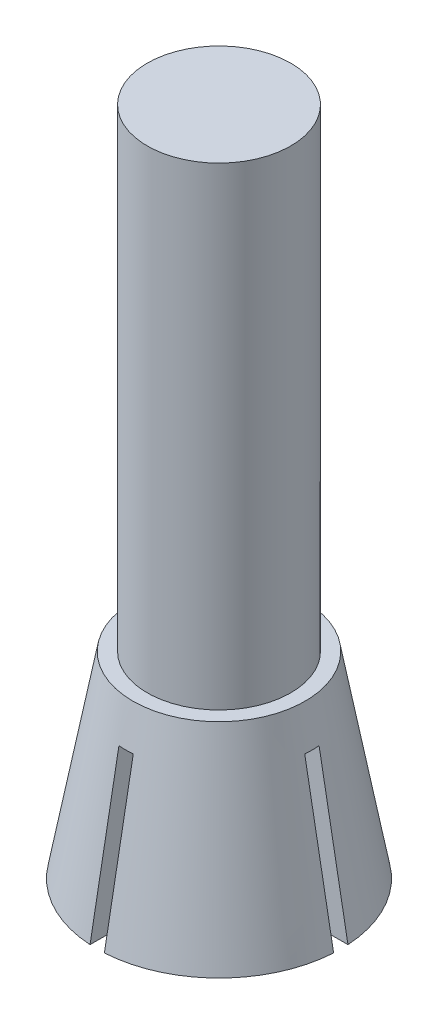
ISO-10303-21;
HEADER;
FILE_DESCRIPTION(('STEP AP214'),'2;1');
FILE_NAME('part.step','',(''),(''),'','','');
FILE_SCHEMA(('AUTOMOTIVE_DESIGN { 1 0 10303 214 1 1 1 1 }'));
ENDSEC;
DATA;
#1=APPLICATION_CONTEXT('core data for automotive mechanical design processes');
#2=APPLICATION_PROTOCOL_DEFINITION('international standard','automotive_design',2000,#1);
#3=PRODUCT_CONTEXT('',#1,'mechanical');
#4=PRODUCT('Part','Part','',(#3));
#5=PRODUCT_RELATED_PRODUCT_CATEGORY('part','',(#4));
#6=PRODUCT_DEFINITION_FORMATION('','',#4);
#7=PRODUCT_DEFINITION_CONTEXT('part definition',#1,'design');
#8=PRODUCT_DEFINITION('design','',#6,#7);
#9=PRODUCT_DEFINITION_SHAPE('','',#8);
#10=(LENGTH_UNIT() NAMED_UNIT(*) SI_UNIT(.MILLI.,.METRE.));
#11=(NAMED_UNIT(*) PLANE_ANGLE_UNIT() SI_UNIT($,.RADIAN.));
#12=(NAMED_UNIT(*) SI_UNIT($,.STERADIAN.) SOLID_ANGLE_UNIT());
#13=UNCERTAINTY_MEASURE_WITH_UNIT(LENGTH_MEASURE(1.E-05),#10,'distance_accuracy_value','');
#14=(GEOMETRIC_REPRESENTATION_CONTEXT(3) GLOBAL_UNCERTAINTY_ASSIGNED_CONTEXT((#13)) GLOBAL_UNIT_ASSIGNED_CONTEXT((#10,
#11,#12)) REPRESENTATION_CONTEXT('',''));
#15=CARTESIAN_POINT('',(0.,0.,0.));
#16=DIRECTION('',(0.,0.,1.));
#17=DIRECTION('',(1.,0.,0.));
#18=AXIS2_PLACEMENT_3D('',#15,#16,#17);
#19=CARTESIAN_POINT('',(4.25,0.,0.));
#20=DIRECTION('',(0.,-1.,0.));
#21=DIRECTION('',(0.,0.,-1.));
#22=AXIS2_PLACEMENT_3D('',#19,#20,#21);
#23=PLANE('',#22);
#24=DIRECTION('',(-1.,0.,0.));
#25=VECTOR('',#24,1.);
#26=CARTESIAN_POINT('',(-5.,0.,0.25));
#27=LINE('',#26,#25);
#28=CARTESIAN_POINT('',(-1.5499677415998,0.,0.25));
#29=VERTEX_POINT('',#28);
#30=CARTESIAN_POINT('',(-4.24264068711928,0.,0.25));
#31=VERTEX_POINT('',#30);
#32=EDGE_CURVE('E149',#29,#31,#27,.T.);
#33=ORIENTED_EDGE('',*,*,#32,.F.);
#34=CARTESIAN_POINT('',(0.,0.,0.));
#35=DIRECTION('',(0.,-1.,0.));
#36=DIRECTION('',(0.,0.,-1.));
#37=AXIS2_PLACEMENT_3D('',#34,#35,#36);
#38=CIRCLE('',#37,1.57);
#39=CARTESIAN_POINT('',(-0.25,0.,1.5499677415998));
#40=VERTEX_POINT('',#39);
#41=EDGE_CURVE('E163',#40,#29,#38,.T.);
#42=ORIENTED_EDGE('',*,*,#41,.F.);
#43=DIRECTION('',(0.,0.,-1.));
#44=VECTOR('',#43,1.);
#45=CARTESIAN_POINT('',(-0.25,0.,0.25));
#46=LINE('',#45,#44);
#47=CARTESIAN_POINT('',(-0.25,0.,4.24264068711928));
#48=VERTEX_POINT('',#47);
#49=EDGE_CURVE('E250',#48,#40,#46,.T.);
#50=ORIENTED_EDGE('',*,*,#49,.F.);
#51=CARTESIAN_POINT('',(0.,0.,0.));
#52=DIRECTION('',(0.,-1.,0.));
#53=DIRECTION('',(0.,0.,-1.));
#54=AXIS2_PLACEMENT_3D('',#51,#52,#53);
#55=CIRCLE('',#54,4.25);
#56=EDGE_CURVE('E165',#48,#31,#55,.T.);
#57=ORIENTED_EDGE('',*,*,#56,.T.);
#58=EDGE_LOOP('',(#33,#42,#50,#57));
#59=FACE_BOUND('',#58,.T.);
#60=ADVANCED_FACE('F34',(#59),#23,.T.);
#61=DIRECTION('',(0.,0.,1.));
#62=VECTOR('',#61,1.);
#63=CARTESIAN_POINT('',(0.25,0.,5.));
#64=LINE('',#63,#62);
#65=CARTESIAN_POINT('',(0.25,0.,1.5499677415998));
#66=VERTEX_POINT('',#65);
#67=CARTESIAN_POINT('',(0.25,0.,4.24264068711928));
#68=VERTEX_POINT('',#67);
#69=EDGE_CURVE('E248',#66,#68,#64,.T.);
#70=ORIENTED_EDGE('',*,*,#69,.F.);
#71=CARTESIAN_POINT('',(1.5499677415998,0.,0.25));
#72=VERTEX_POINT('',#71);
#73=EDGE_CURVE('E174',#72,#66,#38,.T.);
#74=ORIENTED_EDGE('',*,*,#73,.F.);
#75=DIRECTION('',(-1.,0.,0.));
#76=VECTOR('',#75,1.);
#77=CARTESIAN_POINT('',(0.25,0.,0.25));
#78=LINE('',#77,#76);
#79=CARTESIAN_POINT('',(4.24264068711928,0.,0.25));
#80=VERTEX_POINT('',#79);
#81=EDGE_CURVE('E246',#80,#72,#78,.T.);
#82=ORIENTED_EDGE('',*,*,#81,.F.);
#83=EDGE_CURVE('E190',#80,#68,#55,.T.);
#84=ORIENTED_EDGE('',*,*,#83,.T.);
#85=EDGE_LOOP('',(#70,#74,#82,#84));
#86=FACE_BOUND('',#85,.T.);
#87=ADVANCED_FACE('F352',(#86),#23,.T.);
#88=DIRECTION('',(1.,0.,0.));
#89=VECTOR('',#88,1.);
#90=CARTESIAN_POINT('',(5.,0.,-0.25));
#91=LINE('',#90,#89);
#92=CARTESIAN_POINT('',(1.5499677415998,0.,-0.25));
#93=VERTEX_POINT('',#92);
#94=CARTESIAN_POINT('',(4.24264068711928,0.,-0.25));
#95=VERTEX_POINT('',#94);
#96=EDGE_CURVE('E244',#93,#95,#91,.T.);
#97=ORIENTED_EDGE('',*,*,#96,.F.);
#98=CARTESIAN_POINT('',(0.25,0.,-1.5499677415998));
#99=VERTEX_POINT('',#98);
#100=EDGE_CURVE('E178',#99,#93,#38,.T.);
#101=ORIENTED_EDGE('',*,*,#100,.F.);
#102=DIRECTION('',(0.,0.,1.));
#103=VECTOR('',#102,1.);
#104=CARTESIAN_POINT('',(0.25,0.,-0.25));
#105=LINE('',#104,#103);
#106=CARTESIAN_POINT('',(0.25,0.,-4.24264068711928));
#107=VERTEX_POINT('',#106);
#108=EDGE_CURVE('E239',#107,#99,#105,.T.);
#109=ORIENTED_EDGE('',*,*,#108,.F.);
#110=EDGE_CURVE('E186',#107,#95,#55,.T.);
#111=ORIENTED_EDGE('',*,*,#110,.T.);
#112=EDGE_LOOP('',(#97,#101,#109,#111));
#113=FACE_BOUND('',#112,.T.);
#114=ADVANCED_FACE('F356',(#113),#23,.T.);
#115=CARTESIAN_POINT('',(0.,23.35,0.));
#116=DIRECTION('',(0.,1.,0.));
#117=DIRECTION('',(0.,0.,1.));
#118=AXIS2_PLACEMENT_3D('',#115,#116,#117);
#119=PLANE('',#118);
#120=CARTESIAN_POINT('',(0.,23.35,0.));
#121=DIRECTION('',(0.,-1.,0.));
#122=DIRECTION('',(0.,0.,-1.));
#123=AXIS2_PLACEMENT_3D('',#120,#121,#122);
#124=CIRCLE('',#123,2.5);
#125=CARTESIAN_POINT('',(0.,23.35,-2.5));
#126=VERTEX_POINT('',#125);
#127=EDGE_CURVE('E196',#126,#126,#124,.T.);
#128=ORIENTED_EDGE('',*,*,#127,.F.);
#129=EDGE_LOOP('',(#128));
#130=FACE_BOUND('',#129,.T.);
#131=ADVANCED_FACE('F36',(#130),#119,.T.);
#132=CARTESIAN_POINT('',(0.,0.,0.));
#133=DIRECTION('',(0.,-1.,0.));
#134=DIRECTION('',(0.,0.,-1.));
#135=AXIS2_PLACEMENT_3D('',#132,#133,#134);
#136=CYLINDRICAL_SURFACE('',#135,2.5);
#137=ORIENTED_EDGE('',*,*,#127,.T.);
#138=EDGE_LOOP('',(#137));
#139=FACE_BOUND('',#138,.T.);
#140=CARTESIAN_POINT('',(0.,6.85,0.));
#141=DIRECTION('',(0.,-1.,0.));
#142=DIRECTION('',(0.,0.,-1.));
#143=AXIS2_PLACEMENT_3D('',#140,#141,#142);
#144=CIRCLE('',#143,2.5);
#145=CARTESIAN_POINT('',(0.,6.85,-2.5));
#146=VERTEX_POINT('',#145);
#147=EDGE_CURVE('E193',#146,#146,#144,.T.);
#148=ORIENTED_EDGE('',*,*,#147,.F.);
#149=EDGE_LOOP('',(#148));
#150=FACE_BOUND('',#149,.T.);
#151=ADVANCED_FACE('F368',(#139,#150),#136,.T.);
#152=CARTESIAN_POINT('',(2.5,6.85,0.));
#153=DIRECTION('',(0.,1.,0.));
#154=DIRECTION('',(0.,0.,1.));
#155=AXIS2_PLACEMENT_3D('',#152,#153,#154);
#156=PLANE('',#155);
#157=ORIENTED_EDGE('',*,*,#147,.T.);
#158=EDGE_LOOP('',(#157));
#159=FACE_BOUND('',#158,.T.);
#160=CARTESIAN_POINT('',(0.,6.85,0.));
#161=DIRECTION('',(0.,-1.,0.));
#162=DIRECTION('',(0.,0.,-1.));
#163=AXIS2_PLACEMENT_3D('',#160,#161,#162);
#164=CIRCLE('',#163,3.);
#165=CARTESIAN_POINT('',(0.,6.85,-3.));
#166=VERTEX_POINT('',#165);
#167=EDGE_CURVE('E189',#166,#166,#164,.T.);
#168=ORIENTED_EDGE('',*,*,#167,.F.);
#169=EDGE_LOOP('',(#168));
#170=FACE_BOUND('',#169,.T.);
#171=ADVANCED_FACE('F276',(#159,#170),#156,.T.);
#172=CARTESIAN_POINT('',(0.,0.,0.));
#173=DIRECTION('',(0.,-1.,0.));
#174=DIRECTION('',(0.,0.,-1.));
#175=AXIS2_PLACEMENT_3D('',#172,#173,#174);
#176=CONICAL_SURFACE('',#175,4.25,0.180495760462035);
#177=CARTESIAN_POINT('',(-5.33756511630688,-5.99192317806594,0.25));
#178=CARTESIAN_POINT('',(-5.12951728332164,-4.85308658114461,0.25));
#179=CARTESIAN_POINT('',(-4.92144923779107,-3.71425367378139,0.25));
#180=CARTESIAN_POINT('',(-4.50523678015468,-1.43660071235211,0.25));
#181=CARTESIAN_POINT('',(-4.29709236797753,-0.297780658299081,0.25));
#182=CARTESIAN_POINT('',(-3.98479180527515,1.41043410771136,0.25));
#183=CARTESIAN_POINT('',(-3.88067762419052,1.97983649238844,0.25));
#184=CARTESIAN_POINT('',(-3.67241302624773,3.11863453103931,0.25));
#185=CARTESIAN_POINT('',(-3.56826260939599,3.68803018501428,0.25));
#186=CARTESIAN_POINT('',(-3.35991518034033,4.82681233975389,0.25));
#187=CARTESIAN_POINT('',(-3.25571816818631,5.39619884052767,0.25));
#188=CARTESIAN_POINT('',(-3.04726212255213,6.53496085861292,0.25));
#189=CARTESIAN_POINT('',(-2.94300308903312,7.10433637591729,0.25));
#190=CARTESIAN_POINT('',(-2.74122250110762,8.2058308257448,0.25));
#191=CARTESIAN_POINT('',(-2.64370630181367,8.73795073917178,0.25));
#192=CARTESIAN_POINT('',(-2.44857160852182,9.80217157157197,0.25));
#193=CARTESIAN_POINT('',(-2.35095311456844,10.3342724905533,0.25));
#194=CARTESIAN_POINT('',(-2.15556967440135,11.3984456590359,0.25));
#195=CARTESIAN_POINT('',(-2.05780472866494,11.9305179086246,0.25));
#196=CARTESIAN_POINT('',(-1.86205176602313,12.9946223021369,0.25));
#197=CARTESIAN_POINT('',(-1.76406374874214,13.5266544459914,0.25));
#198=CARTESIAN_POINT('',(-1.56773112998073,14.5906594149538,0.25));
#199=CARTESIAN_POINT('',(-1.46938652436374,15.1226322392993,0.25));
#200=CARTESIAN_POINT('',(-1.32138614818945,15.920500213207,0.25));
#201=CARTESIAN_POINT('',(-1.27197225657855,16.1864402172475,0.25));
#202=CARTESIAN_POINT('',(-1.1729137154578,16.7182777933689,0.25));
#203=CARTESIAN_POINT('',(-1.12326906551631,16.9841753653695,0.25));
#204=CARTESIAN_POINT('',(-1.02364003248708,17.5159123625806,0.25));
#205=CARTESIAN_POINT('',(-0.97365564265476,17.7817517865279,0.25));
#206=CARTESIAN_POINT('',(-0.873163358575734,18.3133305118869,0.25));
#207=CARTESIAN_POINT('',(-0.822655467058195,18.5790698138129,0.25));
#208=CARTESIAN_POINT('',(-0.74621709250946,18.9775524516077,0.25));
#209=CARTESIAN_POINT('',(-0.720624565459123,19.1103605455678,0.25));
#210=CARTESIAN_POINT('',(-0.66912430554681,19.3759151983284,0.25));
#211=CARTESIAN_POINT('',(-0.64321657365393,19.5086617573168,0.25));
#212=CARTESIAN_POINT('',(-0.590965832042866,19.7740721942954,0.25));
#213=CARTESIAN_POINT('',(-0.564622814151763,19.9067360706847,0.25));
#214=CARTESIAN_POINT('',(-0.511242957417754,20.1719254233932,0.25));
#215=CARTESIAN_POINT('',(-0.484206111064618,20.3044508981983,0.25));
#216=CARTESIAN_POINT('',(-0.456693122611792,20.4368791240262,0.25));
#217=B_SPLINE_CURVE_WITH_KNOTS('',3,(#177,#178,#179,#180,#181,#182,#183,#184,#185,#186,#187,
#188,#189,#190,#191,#192,#193,#194,#195,#196,#197,#198,#199,#200,#201,#202,#203,#204,#205,#206,
#207,#208,#209,#210,#211,#212,#213,#214,#215,#216),.UNSPECIFIED.,.F.,.F.,(4,2,2,2,2,2,2,2,2,2,2,
2,2,2,2,2,2,2,2,4),(0.,3.47305258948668,6.94610843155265,8.68263644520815,10.4191641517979,
12.1556900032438,13.8922169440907,15.5151615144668,17.1381053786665,18.7610439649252,
20.3839852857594,22.0069454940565,22.8184208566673,23.6298977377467,24.4413907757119,
25.2528795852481,25.658633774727,26.0643867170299,26.4701472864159,26.8759122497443),.UNSPECIFIED.);
#218=CARTESIAN_POINT('',(-3.23670985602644,5.5,0.25));
#219=VERTEX_POINT('',#218);
#220=EDGE_CURVE('E315',#31,#219,#217,.T.);
#221=ORIENTED_EDGE('',*,*,#220,.F.);
#222=ORIENTED_EDGE('',*,*,#56,.F.);
#223=CARTESIAN_POINT('',(-0.25,-5.99192317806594,5.33756511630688));
#224=CARTESIAN_POINT('',(-0.25,-4.85308658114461,5.12951728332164));
#225=CARTESIAN_POINT('',(-0.25,-3.71425367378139,4.92144923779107));
#226=CARTESIAN_POINT('',(-0.25,-1.43660071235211,4.50523678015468));
#227=CARTESIAN_POINT('',(-0.25,-0.297780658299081,4.29709236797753));
#228=CARTESIAN_POINT('',(-0.25,1.41043410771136,3.98479180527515));
#229=CARTESIAN_POINT('',(-0.25,1.97983649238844,3.88067762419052));
#230=CARTESIAN_POINT('',(-0.25,3.11863453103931,3.67241302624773));
#231=CARTESIAN_POINT('',(-0.25,3.68803018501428,3.56826260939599));
#232=CARTESIAN_POINT('',(-0.25,4.82681233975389,3.35991518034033));
#233=CARTESIAN_POINT('',(-0.25,5.39619884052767,3.25571816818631));
#234=CARTESIAN_POINT('',(-0.25,6.53496085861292,3.04726212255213));
#235=CARTESIAN_POINT('',(-0.25,7.10433637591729,2.94300308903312));
#236=CARTESIAN_POINT('',(-0.25,8.2058308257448,2.74122250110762));
#237=CARTESIAN_POINT('',(-0.25,8.73795073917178,2.64370630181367));
#238=CARTESIAN_POINT('',(-0.25,9.80217157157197,2.44857160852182));
#239=CARTESIAN_POINT('',(-0.25,10.3342724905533,2.35095311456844));
#240=CARTESIAN_POINT('',(-0.25,11.3984456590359,2.15556967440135));
#241=CARTESIAN_POINT('',(-0.25,11.9305179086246,2.05780472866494));
#242=CARTESIAN_POINT('',(-0.25,12.9946223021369,1.86205176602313));
#243=CARTESIAN_POINT('',(-0.25,13.5266544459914,1.76406374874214));
#244=CARTESIAN_POINT('',(-0.25,14.5906594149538,1.56773112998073));
#245=CARTESIAN_POINT('',(-0.25,15.1226322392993,1.46938652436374));
#246=CARTESIAN_POINT('',(-0.25,15.920500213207,1.32138614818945));
#247=CARTESIAN_POINT('',(-0.25,16.1864402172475,1.27197225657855));
#248=CARTESIAN_POINT('',(-0.25,16.7182777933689,1.1729137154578));
#249=CARTESIAN_POINT('',(-0.25,16.9841753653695,1.12326906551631));
#250=CARTESIAN_POINT('',(-0.25,17.5159123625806,1.02364003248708));
#251=CARTESIAN_POINT('',(-0.25,17.7817517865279,0.97365564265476));
#252=CARTESIAN_POINT('',(-0.25,18.3133305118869,0.873163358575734));
#253=CARTESIAN_POINT('',(-0.25,18.5790698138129,0.822655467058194));
#254=CARTESIAN_POINT('',(-0.25,18.9775524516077,0.74621709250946));
#255=CARTESIAN_POINT('',(-0.25,19.1103605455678,0.720624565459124));
#256=CARTESIAN_POINT('',(-0.25,19.3759151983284,0.66912430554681));
#257=CARTESIAN_POINT('',(-0.25,19.5086617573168,0.64321657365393));
#258=CARTESIAN_POINT('',(-0.25,19.7740721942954,0.590965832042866));
#259=CARTESIAN_POINT('',(-0.25,19.9067360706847,0.564622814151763));
#260=CARTESIAN_POINT('',(-0.25,20.1719254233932,0.511242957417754));
#261=CARTESIAN_POINT('',(-0.25,20.3044508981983,0.484206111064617));
#262=CARTESIAN_POINT('',(-0.25,20.4368791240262,0.456693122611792));
#263=B_SPLINE_CURVE_WITH_KNOTS('',3,(#223,#224,#225,#226,#227,#228,#229,#230,#231,#232,#233,
#234,#235,#236,#237,#238,#239,#240,#241,#242,#243,#244,#245,#246,#247,#248,#249,#250,#251,#252,
#253,#254,#255,#256,#257,#258,#259,#260,#261,#262),.UNSPECIFIED.,.F.,.F.,(4,2,2,2,2,2,2,2,2,2,2,
2,2,2,2,2,2,2,2,4),(0.,3.47305258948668,6.94610843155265,8.68263644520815,10.4191641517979,
12.1556900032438,13.8922169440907,15.5151615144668,17.1381053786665,18.7610439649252,
20.3839852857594,22.0069454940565,22.8184208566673,23.6298977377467,24.4413907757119,
25.2528795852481,25.658633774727,26.0643867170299,26.4701472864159,26.8759122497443),.UNSPECIFIED.);
#264=CARTESIAN_POINT('',(-0.25,5.5,3.23670985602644));
#265=VERTEX_POINT('',#264);
#266=EDGE_CURVE('E310',#265,#48,#263,.F.);
#267=ORIENTED_EDGE('',*,*,#266,.F.);
#268=CARTESIAN_POINT('',(0.,5.5,0.));
#269=DIRECTION('',(0.,-1.,0.));
#270=DIRECTION('',(0.,0.,-1.));
#271=AXIS2_PLACEMENT_3D('',#268,#269,#270);
#272=CIRCLE('',#271,3.2463503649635);
#273=CARTESIAN_POINT('',(0.25,5.5,3.23670985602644));
#274=VERTEX_POINT('',#273);
#275=EDGE_CURVE('E397',#265,#274,#272,.F.);
#276=ORIENTED_EDGE('',*,*,#275,.T.);
#277=CARTESIAN_POINT('',(0.25,-5.99192317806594,5.33756511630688));
#278=CARTESIAN_POINT('',(0.25,-4.85308658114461,5.12951728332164));
#279=CARTESIAN_POINT('',(0.25,-3.71425367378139,4.92144923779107));
#280=CARTESIAN_POINT('',(0.25,-1.43660071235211,4.50523678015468));
#281=CARTESIAN_POINT('',(0.25,-0.297780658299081,4.29709236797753));
#282=CARTESIAN_POINT('',(0.25,1.41043410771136,3.98479180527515));
#283=CARTESIAN_POINT('',(0.25,1.97983649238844,3.88067762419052));
#284=CARTESIAN_POINT('',(0.25,3.11863453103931,3.67241302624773));
#285=CARTESIAN_POINT('',(0.25,3.68803018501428,3.56826260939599));
#286=CARTESIAN_POINT('',(0.25,4.82681233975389,3.35991518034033));
#287=CARTESIAN_POINT('',(0.25,5.39619884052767,3.25571816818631));
#288=CARTESIAN_POINT('',(0.25,6.53496085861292,3.04726212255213));
#289=CARTESIAN_POINT('',(0.25,7.10433637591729,2.94300308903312));
#290=CARTESIAN_POINT('',(0.25,8.2058308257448,2.74122250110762));
#291=CARTESIAN_POINT('',(0.25,8.73795073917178,2.64370630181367));
#292=CARTESIAN_POINT('',(0.25,9.80217157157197,2.44857160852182));
#293=CARTESIAN_POINT('',(0.25,10.3342724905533,2.35095311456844));
#294=CARTESIAN_POINT('',(0.25,11.3984456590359,2.15556967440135));
#295=CARTESIAN_POINT('',(0.25,11.9305179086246,2.05780472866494));
#296=CARTESIAN_POINT('',(0.25,12.9946223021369,1.86205176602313));
#297=CARTESIAN_POINT('',(0.25,13.5266544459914,1.76406374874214));
#298=CARTESIAN_POINT('',(0.25,14.5906594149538,1.56773112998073));
#299=CARTESIAN_POINT('',(0.25,15.1226322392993,1.46938652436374));
#300=CARTESIAN_POINT('',(0.25,15.920500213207,1.32138614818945));
#301=CARTESIAN_POINT('',(0.25,16.1864402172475,1.27197225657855));
#302=CARTESIAN_POINT('',(0.25,16.7182777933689,1.1729137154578));
#303=CARTESIAN_POINT('',(0.25,16.9841753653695,1.12326906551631));
#304=CARTESIAN_POINT('',(0.25,17.5159123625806,1.02364003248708));
#305=CARTESIAN_POINT('',(0.25,17.7817517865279,0.97365564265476));
#306=CARTESIAN_POINT('',(0.25,18.3133305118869,0.873163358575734));
#307=CARTESIAN_POINT('',(0.25,18.5790698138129,0.822655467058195));
#308=CARTESIAN_POINT('',(0.25,18.9775524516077,0.74621709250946));
#309=CARTESIAN_POINT('',(0.25,19.1103605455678,0.720624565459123));
#310=CARTESIAN_POINT('',(0.25,19.3759151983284,0.66912430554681));
#311=CARTESIAN_POINT('',(0.25,19.5086617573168,0.64321657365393));
#312=CARTESIAN_POINT('',(0.25,19.7740721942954,0.590965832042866));
#313=CARTESIAN_POINT('',(0.25,19.9067360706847,0.564622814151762));
#314=CARTESIAN_POINT('',(0.25,20.1719254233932,0.511242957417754));
#315=CARTESIAN_POINT('',(0.25,20.3044508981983,0.484206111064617));
#316=CARTESIAN_POINT('',(0.25,20.4368791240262,0.456693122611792));
#317=B_SPLINE_CURVE_WITH_KNOTS('',3,(#277,#278,#279,#280,#281,#282,#283,#284,#285,#286,#287,
#288,#289,#290,#291,#292,#293,#294,#295,#296,#297,#298,#299,#300,#301,#302,#303,#304,#305,#306,
#307,#308,#309,#310,#311,#312,#313,#314,#315,#316),.UNSPECIFIED.,.F.,.F.,(4,2,2,2,2,2,2,2,2,2,2,
2,2,2,2,2,2,2,2,4),(0.,3.47305258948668,6.94610843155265,8.68263644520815,10.4191641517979,
12.1556900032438,13.8922169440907,15.5151615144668,17.1381053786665,18.7610439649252,
20.3839852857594,22.0069454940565,22.8184208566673,23.6298977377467,24.4413907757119,
25.2528795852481,25.658633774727,26.0643867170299,26.4701472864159,26.8759122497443),.UNSPECIFIED.);
#318=EDGE_CURVE('E304',#68,#274,#317,.T.);
#319=ORIENTED_EDGE('',*,*,#318,.F.);
#320=ORIENTED_EDGE('',*,*,#83,.F.);
#321=CARTESIAN_POINT('',(5.33756511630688,-5.99192317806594,0.25));
#322=CARTESIAN_POINT('',(5.12951728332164,-4.85308658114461,0.25));
#323=CARTESIAN_POINT('',(4.92144923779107,-3.71425367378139,0.25));
#324=CARTESIAN_POINT('',(4.50523678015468,-1.43660071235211,0.25));
#325=CARTESIAN_POINT('',(4.29709236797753,-0.297780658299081,0.25));
#326=CARTESIAN_POINT('',(3.98479180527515,1.41043410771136,0.25));
#327=CARTESIAN_POINT('',(3.88067762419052,1.97983649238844,0.25));
#328=CARTESIAN_POINT('',(3.67241302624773,3.11863453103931,0.25));
#329=CARTESIAN_POINT('',(3.56826260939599,3.68803018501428,0.25));
#330=CARTESIAN_POINT('',(3.35991518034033,4.82681233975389,0.25));
#331=CARTESIAN_POINT('',(3.25571816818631,5.39619884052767,0.25));
#332=CARTESIAN_POINT('',(3.04726212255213,6.53496085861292,0.25));
#333=CARTESIAN_POINT('',(2.94300308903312,7.10433637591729,0.25));
#334=CARTESIAN_POINT('',(2.74122250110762,8.2058308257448,0.25));
#335=CARTESIAN_POINT('',(2.64370630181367,8.73795073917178,0.25));
#336=CARTESIAN_POINT('',(2.44857160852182,9.80217157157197,0.25));
#337=CARTESIAN_POINT('',(2.35095311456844,10.3342724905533,0.25));
#338=CARTESIAN_POINT('',(2.15556967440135,11.3984456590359,0.25));
#339=CARTESIAN_POINT('',(2.05780472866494,11.9305179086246,0.25));
#340=CARTESIAN_POINT('',(1.86205176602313,12.9946223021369,0.25));
#341=CARTESIAN_POINT('',(1.76406374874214,13.5266544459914,0.25));
#342=CARTESIAN_POINT('',(1.56773112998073,14.5906594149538,0.25));
#343=CARTESIAN_POINT('',(1.46938652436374,15.1226322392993,0.25));
#344=CARTESIAN_POINT('',(1.32138614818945,15.920500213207,0.25));
#345=CARTESIAN_POINT('',(1.27197225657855,16.1864402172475,0.25));
#346=CARTESIAN_POINT('',(1.1729137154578,16.7182777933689,0.25));
#347=CARTESIAN_POINT('',(1.12326906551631,16.9841753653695,0.25));
#348=CARTESIAN_POINT('',(1.02364003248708,17.5159123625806,0.25));
#349=CARTESIAN_POINT('',(0.97365564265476,17.7817517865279,0.25));
#350=CARTESIAN_POINT('',(0.873163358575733,18.3133305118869,0.25));
#351=CARTESIAN_POINT('',(0.822655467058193,18.5790698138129,0.25));
#352=CARTESIAN_POINT('',(0.746217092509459,18.9775524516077,0.25));
#353=CARTESIAN_POINT('',(0.720624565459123,19.1103605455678,0.25));
#354=CARTESIAN_POINT('',(0.669124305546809,19.3759151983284,0.25));
#355=CARTESIAN_POINT('',(0.643216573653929,19.5086617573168,0.25));
#356=CARTESIAN_POINT('',(0.590965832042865,19.7740721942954,0.25));
#357=CARTESIAN_POINT('',(0.564622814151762,19.9067360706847,0.25));
#358=CARTESIAN_POINT('',(0.511242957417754,20.1719254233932,0.25));
#359=CARTESIAN_POINT('',(0.484206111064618,20.3044508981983,0.25));
#360=CARTESIAN_POINT('',(0.456693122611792,20.4368791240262,0.25));
#361=B_SPLINE_CURVE_WITH_KNOTS('',3,(#321,#322,#323,#324,#325,#326,#327,#328,#329,#330,#331,
#332,#333,#334,#335,#336,#337,#338,#339,#340,#341,#342,#343,#344,#345,#346,#347,#348,#349,#350,
#351,#352,#353,#354,#355,#356,#357,#358,#359,#360),.UNSPECIFIED.,.F.,.F.,(4,2,2,2,2,2,2,2,2,2,2,
2,2,2,2,2,2,2,2,4),(0.,3.47305258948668,6.94610843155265,8.68263644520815,10.4191641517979,
12.1556900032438,13.8922169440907,15.5151615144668,17.1381053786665,18.7610439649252,
20.3839852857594,22.0069454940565,22.8184208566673,23.6298977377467,24.4413907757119,
25.2528795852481,25.658633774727,26.0643867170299,26.4701472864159,26.8759122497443),.UNSPECIFIED.);
#362=CARTESIAN_POINT('',(3.23670985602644,5.5,0.25));
#363=VERTEX_POINT('',#362);
#364=EDGE_CURVE('E298',#363,#80,#361,.F.);
#365=ORIENTED_EDGE('',*,*,#364,.F.);
#366=CARTESIAN_POINT('',(3.23670985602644,5.5,-0.25));
#367=VERTEX_POINT('',#366);
#368=EDGE_CURVE('E255',#363,#367,#272,.F.);
#369=ORIENTED_EDGE('',*,*,#368,.T.);
#370=CARTESIAN_POINT('',(5.33756511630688,-5.99192317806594,-0.25));
#371=CARTESIAN_POINT('',(5.12951728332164,-4.85308658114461,-0.25));
#372=CARTESIAN_POINT('',(4.92144923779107,-3.71425367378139,-0.25));
#373=CARTESIAN_POINT('',(4.50523678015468,-1.43660071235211,-0.25));
#374=CARTESIAN_POINT('',(4.29709236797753,-0.297780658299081,-0.25));
#375=CARTESIAN_POINT('',(3.98479180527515,1.41043410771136,-0.25));
#376=CARTESIAN_POINT('',(3.88067762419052,1.97983649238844,-0.25));
#377=CARTESIAN_POINT('',(3.67241302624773,3.11863453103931,-0.25));
#378=CARTESIAN_POINT('',(3.56826260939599,3.68803018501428,-0.25));
#379=CARTESIAN_POINT('',(3.35991518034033,4.82681233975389,-0.25));
#380=CARTESIAN_POINT('',(3.25571816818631,5.39619884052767,-0.25));
#381=CARTESIAN_POINT('',(3.04726212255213,6.53496085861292,-0.25));
#382=CARTESIAN_POINT('',(2.94300308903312,7.10433637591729,-0.25));
#383=CARTESIAN_POINT('',(2.74122250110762,8.2058308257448,-0.25));
#384=CARTESIAN_POINT('',(2.64370630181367,8.73795073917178,-0.25));
#385=CARTESIAN_POINT('',(2.44857160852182,9.80217157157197,-0.25));
#386=CARTESIAN_POINT('',(2.35095311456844,10.3342724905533,-0.25));
#387=CARTESIAN_POINT('',(2.15556967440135,11.3984456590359,-0.25));
#388=CARTESIAN_POINT('',(2.05780472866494,11.9305179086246,-0.25));
#389=CARTESIAN_POINT('',(1.86205176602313,12.9946223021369,-0.25));
#390=CARTESIAN_POINT('',(1.76406374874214,13.5266544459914,-0.25));
#391=CARTESIAN_POINT('',(1.56773112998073,14.5906594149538,-0.25));
#392=CARTESIAN_POINT('',(1.46938652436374,15.1226322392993,-0.25));
#393=CARTESIAN_POINT('',(1.32138614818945,15.920500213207,-0.25));
#394=CARTESIAN_POINT('',(1.27197225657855,16.1864402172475,-0.25));
#395=CARTESIAN_POINT('',(1.1729137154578,16.7182777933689,-0.25));
#396=CARTESIAN_POINT('',(1.12326906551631,16.9841753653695,-0.25));
#397=CARTESIAN_POINT('',(1.02364003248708,17.5159123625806,-0.25));
#398=CARTESIAN_POINT('',(0.97365564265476,17.7817517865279,-0.25));
#399=CARTESIAN_POINT('',(0.873163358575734,18.3133305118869,-0.25));
#400=CARTESIAN_POINT('',(0.822655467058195,18.5790698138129,-0.25));
#401=CARTESIAN_POINT('',(0.74621709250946,18.9775524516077,-0.25));
#402=CARTESIAN_POINT('',(0.720624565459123,19.1103605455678,-0.25));
#403=CARTESIAN_POINT('',(0.66912430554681,19.3759151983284,-0.25));
#404=CARTESIAN_POINT('',(0.64321657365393,19.5086617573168,-0.25));
#405=CARTESIAN_POINT('',(0.590965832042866,19.7740721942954,-0.25));
#406=CARTESIAN_POINT('',(0.564622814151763,19.9067360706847,-0.25));
#407=CARTESIAN_POINT('',(0.511242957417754,20.1719254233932,-0.25));
#408=CARTESIAN_POINT('',(0.484206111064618,20.3044508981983,-0.25));
#409=CARTESIAN_POINT('',(0.456693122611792,20.4368791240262,-0.25));
#410=B_SPLINE_CURVE_WITH_KNOTS('',3,(#370,#371,#372,#373,#374,#375,#376,#377,#378,#379,#380,
#381,#382,#383,#384,#385,#386,#387,#388,#389,#390,#391,#392,#393,#394,#395,#396,#397,#398,#399,
#400,#401,#402,#403,#404,#405,#406,#407,#408,#409),.UNSPECIFIED.,.F.,.F.,(4,2,2,2,2,2,2,2,2,2,2,
2,2,2,2,2,2,2,2,4),(0.,3.47305258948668,6.94610843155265,8.68263644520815,10.4191641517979,
12.1556900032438,13.8922169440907,15.5151615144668,17.1381053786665,18.7610439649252,
20.3839852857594,22.0069454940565,22.8184208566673,23.6298977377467,24.4413907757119,
25.2528795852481,25.658633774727,26.0643867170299,26.4701472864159,26.8759122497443),.UNSPECIFIED.);
#411=EDGE_CURVE('E291',#95,#367,#410,.T.);
#412=ORIENTED_EDGE('',*,*,#411,.F.);
#413=ORIENTED_EDGE('',*,*,#110,.F.);
#414=CARTESIAN_POINT('',(0.25,-5.99192317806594,-5.33756511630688));
#415=CARTESIAN_POINT('',(0.25,-4.85308658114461,-5.12951728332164));
#416=CARTESIAN_POINT('',(0.25,-3.71425367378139,-4.92144923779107));
#417=CARTESIAN_POINT('',(0.25,-1.43660071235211,-4.50523678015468));
#418=CARTESIAN_POINT('',(0.25,-0.297780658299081,-4.29709236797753));
#419=CARTESIAN_POINT('',(0.25,1.41043410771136,-3.98479180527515));
#420=CARTESIAN_POINT('',(0.25,1.97983649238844,-3.88067762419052));
#421=CARTESIAN_POINT('',(0.25,3.11863453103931,-3.67241302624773));
#422=CARTESIAN_POINT('',(0.25,3.68803018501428,-3.56826260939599));
#423=CARTESIAN_POINT('',(0.25,4.82681233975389,-3.35991518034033));
#424=CARTESIAN_POINT('',(0.25,5.39619884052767,-3.25571816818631));
#425=CARTESIAN_POINT('',(0.25,6.53496085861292,-3.04726212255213));
#426=CARTESIAN_POINT('',(0.25,7.10433637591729,-2.94300308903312));
#427=CARTESIAN_POINT('',(0.25,8.2058308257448,-2.74122250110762));
#428=CARTESIAN_POINT('',(0.25,8.73795073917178,-2.64370630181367));
#429=CARTESIAN_POINT('',(0.25,9.80217157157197,-2.44857160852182));
#430=CARTESIAN_POINT('',(0.25,10.3342724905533,-2.35095311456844));
#431=CARTESIAN_POINT('',(0.25,11.3984456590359,-2.15556967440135));
#432=CARTESIAN_POINT('',(0.25,11.9305179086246,-2.05780472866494));
#433=CARTESIAN_POINT('',(0.25,12.9946223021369,-1.86205176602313));
#434=CARTESIAN_POINT('',(0.25,13.5266544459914,-1.76406374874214));
#435=CARTESIAN_POINT('',(0.25,14.5906594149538,-1.56773112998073));
#436=CARTESIAN_POINT('',(0.25,15.1226322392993,-1.46938652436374));
#437=CARTESIAN_POINT('',(0.25,15.920500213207,-1.32138614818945));
#438=CARTESIAN_POINT('',(0.25,16.1864402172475,-1.27197225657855));
#439=CARTESIAN_POINT('',(0.25,16.7182777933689,-1.1729137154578));
#440=CARTESIAN_POINT('',(0.25,16.9841753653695,-1.12326906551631));
#441=CARTESIAN_POINT('',(0.25,17.5159123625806,-1.02364003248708));
#442=CARTESIAN_POINT('',(0.25,17.7817517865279,-0.97365564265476));
#443=CARTESIAN_POINT('',(0.25,18.3133305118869,-0.873163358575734));
#444=CARTESIAN_POINT('',(0.25,18.5790698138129,-0.822655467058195));
#445=CARTESIAN_POINT('',(0.25,18.9775524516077,-0.74621709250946));
#446=CARTESIAN_POINT('',(0.25,19.1103605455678,-0.720624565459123));
#447=CARTESIAN_POINT('',(0.25,19.3759151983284,-0.66912430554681));
#448=CARTESIAN_POINT('',(0.25,19.5086617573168,-0.64321657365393));
#449=CARTESIAN_POINT('',(0.25,19.7740721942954,-0.590965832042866));
#450=CARTESIAN_POINT('',(0.25,19.9067360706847,-0.564622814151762));
#451=CARTESIAN_POINT('',(0.25,20.1719254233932,-0.511242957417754));
#452=CARTESIAN_POINT('',(0.25,20.3044508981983,-0.484206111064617));
#453=CARTESIAN_POINT('',(0.25,20.4368791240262,-0.456693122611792));
#454=B_SPLINE_CURVE_WITH_KNOTS('',3,(#414,#415,#416,#417,#418,#419,#420,#421,#422,#423,#424,
#425,#426,#427,#428,#429,#430,#431,#432,#433,#434,#435,#436,#437,#438,#439,#440,#441,#442,#443,
#444,#445,#446,#447,#448,#449,#450,#451,#452,#453),.UNSPECIFIED.,.F.,.F.,(4,2,2,2,2,2,2,2,2,2,2,
2,2,2,2,2,2,2,2,4),(0.,3.47305258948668,6.94610843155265,8.68263644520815,10.4191641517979,
12.1556900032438,13.8922169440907,15.5151615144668,17.1381053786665,18.7610439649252,
20.3839852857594,22.0069454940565,22.8184208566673,23.6298977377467,24.4413907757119,
25.2528795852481,25.658633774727,26.0643867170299,26.4701472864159,26.8759122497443),.UNSPECIFIED.);
#455=CARTESIAN_POINT('',(0.25,5.5,-3.23670985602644));
#456=VERTEX_POINT('',#455);
#457=EDGE_CURVE('E284',#456,#107,#454,.F.);
#458=ORIENTED_EDGE('',*,*,#457,.F.);
#459=CARTESIAN_POINT('',(-0.25,5.5,-3.23670985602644));
#460=VERTEX_POINT('',#459);
#461=EDGE_CURVE('E252',#456,#460,#272,.F.);
#462=ORIENTED_EDGE('',*,*,#461,.T.);
#463=CARTESIAN_POINT('',(-0.25,-5.99192317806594,-5.33756511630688));
#464=CARTESIAN_POINT('',(-0.25,-4.85308658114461,-5.12951728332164));
#465=CARTESIAN_POINT('',(-0.25,-3.71425367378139,-4.92144923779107));
#466=CARTESIAN_POINT('',(-0.25,-1.43660071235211,-4.50523678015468));
#467=CARTESIAN_POINT('',(-0.25,-0.297780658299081,-4.29709236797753));
#468=CARTESIAN_POINT('',(-0.25,1.41043410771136,-3.98479180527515));
#469=CARTESIAN_POINT('',(-0.25,1.97983649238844,-3.88067762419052));
#470=CARTESIAN_POINT('',(-0.25,3.11863453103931,-3.67241302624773));
#471=CARTESIAN_POINT('',(-0.25,3.68803018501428,-3.56826260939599));
#472=CARTESIAN_POINT('',(-0.25,4.82681233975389,-3.35991518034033));
#473=CARTESIAN_POINT('',(-0.25,5.39619884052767,-3.25571816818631));
#474=CARTESIAN_POINT('',(-0.25,6.53496085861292,-3.04726212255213));
#475=CARTESIAN_POINT('',(-0.25,7.10433637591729,-2.94300308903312));
#476=CARTESIAN_POINT('',(-0.25,8.2058308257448,-2.74122250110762));
#477=CARTESIAN_POINT('',(-0.25,8.73795073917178,-2.64370630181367));
#478=CARTESIAN_POINT('',(-0.25,9.80217157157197,-2.44857160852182));
#479=CARTESIAN_POINT('',(-0.25,10.3342724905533,-2.35095311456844));
#480=CARTESIAN_POINT('',(-0.25,11.3984456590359,-2.15556967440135));
#481=CARTESIAN_POINT('',(-0.25,11.9305179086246,-2.05780472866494));
#482=CARTESIAN_POINT('',(-0.25,12.9946223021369,-1.86205176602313));
#483=CARTESIAN_POINT('',(-0.25,13.5266544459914,-1.76406374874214));
#484=CARTESIAN_POINT('',(-0.25,14.5906594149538,-1.56773112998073));
#485=CARTESIAN_POINT('',(-0.25,15.1226322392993,-1.46938652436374));
#486=CARTESIAN_POINT('',(-0.25,15.920500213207,-1.32138614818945));
#487=CARTESIAN_POINT('',(-0.25,16.1864402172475,-1.27197225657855));
#488=CARTESIAN_POINT('',(-0.25,16.7182777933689,-1.1729137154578));
#489=CARTESIAN_POINT('',(-0.25,16.9841753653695,-1.12326906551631));
#490=CARTESIAN_POINT('',(-0.25,17.5159123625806,-1.02364003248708));
#491=CARTESIAN_POINT('',(-0.25,17.7817517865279,-0.97365564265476));
#492=CARTESIAN_POINT('',(-0.25,18.3133305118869,-0.873163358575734));
#493=CARTESIAN_POINT('',(-0.25,18.5790698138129,-0.822655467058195));
#494=CARTESIAN_POINT('',(-0.25,18.9775524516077,-0.74621709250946));
#495=CARTESIAN_POINT('',(-0.25,19.1103605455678,-0.720624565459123));
#496=CARTESIAN_POINT('',(-0.25,19.3759151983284,-0.66912430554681));
#497=CARTESIAN_POINT('',(-0.25,19.5086617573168,-0.64321657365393));
#498=CARTESIAN_POINT('',(-0.25,19.7740721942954,-0.590965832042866));
#499=CARTESIAN_POINT('',(-0.25,19.9067360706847,-0.564622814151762));
#500=CARTESIAN_POINT('',(-0.25,20.1719254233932,-0.511242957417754));
#501=CARTESIAN_POINT('',(-0.25,20.3044508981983,-0.484206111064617));
#502=CARTESIAN_POINT('',(-0.25,20.4368791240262,-0.456693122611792));
#503=B_SPLINE_CURVE_WITH_KNOTS('',3,(#463,#464,#465,#466,#467,#468,#469,#470,#471,#472,#473,
#474,#475,#476,#477,#478,#479,#480,#481,#482,#483,#484,#485,#486,#487,#488,#489,#490,#491,#492,
#493,#494,#495,#496,#497,#498,#499,#500,#501,#502),.UNSPECIFIED.,.F.,.F.,(4,2,2,2,2,2,2,2,2,2,2,
2,2,2,2,2,2,2,2,4),(0.,3.47305258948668,6.94610843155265,8.68263644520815,10.4191641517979,
12.1556900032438,13.8922169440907,15.5151615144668,17.1381053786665,18.7610439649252,
20.3839852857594,22.0069454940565,22.8184208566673,23.6298977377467,24.4413907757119,
25.2528795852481,25.658633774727,26.0643867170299,26.4701472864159,26.8759122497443),.UNSPECIFIED.);
#504=CARTESIAN_POINT('',(-0.25,0.,-4.24264068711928));
#505=VERTEX_POINT('',#504);
#506=EDGE_CURVE('E262',#505,#460,#503,.T.);
#507=ORIENTED_EDGE('',*,*,#506,.F.);
#508=CARTESIAN_POINT('',(-4.24264068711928,0.,-0.250000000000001));
#509=VERTEX_POINT('',#508);
#510=EDGE_CURVE('E184',#509,#505,#55,.T.);
#511=ORIENTED_EDGE('',*,*,#510,.F.);
#512=CARTESIAN_POINT('',(-5.33756511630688,-5.99192317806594,-0.250000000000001));
#513=CARTESIAN_POINT('',(-5.12951728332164,-4.85308658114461,-0.250000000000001));
#514=CARTESIAN_POINT('',(-4.92144923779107,-3.71425367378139,-0.250000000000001));
#515=CARTESIAN_POINT('',(-4.50523678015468,-1.43660071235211,-0.250000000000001));
#516=CARTESIAN_POINT('',(-4.29709236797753,-0.297780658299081,-0.250000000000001));
#517=CARTESIAN_POINT('',(-3.98479180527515,1.41043410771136,-0.250000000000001));
#518=CARTESIAN_POINT('',(-3.88067762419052,1.97983649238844,-0.25));
#519=CARTESIAN_POINT('',(-3.67241302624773,3.11863453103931,-0.25));
#520=CARTESIAN_POINT('',(-3.56826260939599,3.68803018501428,-0.25));
#521=CARTESIAN_POINT('',(-3.35991518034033,4.82681233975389,-0.25));
#522=CARTESIAN_POINT('',(-3.25571816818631,5.39619884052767,-0.25));
#523=CARTESIAN_POINT('',(-3.04726212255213,6.53496085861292,-0.25));
#524=CARTESIAN_POINT('',(-2.94300308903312,7.10433637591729,-0.25));
#525=CARTESIAN_POINT('',(-2.74122250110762,8.2058308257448,-0.25));
#526=CARTESIAN_POINT('',(-2.64370630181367,8.73795073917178,-0.25));
#527=CARTESIAN_POINT('',(-2.44857160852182,9.80217157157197,-0.25));
#528=CARTESIAN_POINT('',(-2.35095311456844,10.3342724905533,-0.25));
#529=CARTESIAN_POINT('',(-2.15556967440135,11.3984456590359,-0.25));
#530=CARTESIAN_POINT('',(-2.05780472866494,11.9305179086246,-0.25));
#531=CARTESIAN_POINT('',(-1.86205176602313,12.9946223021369,-0.25));
#532=CARTESIAN_POINT('',(-1.76406374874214,13.5266544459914,-0.25));
#533=CARTESIAN_POINT('',(-1.56773112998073,14.5906594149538,-0.25));
#534=CARTESIAN_POINT('',(-1.46938652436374,15.1226322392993,-0.25));
#535=CARTESIAN_POINT('',(-1.32138614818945,15.920500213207,-0.25));
#536=CARTESIAN_POINT('',(-1.27197225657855,16.1864402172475,-0.25));
#537=CARTESIAN_POINT('',(-1.1729137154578,16.7182777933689,-0.25));
#538=CARTESIAN_POINT('',(-1.12326906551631,16.9841753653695,-0.25));
#539=CARTESIAN_POINT('',(-1.02364003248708,17.5159123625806,-0.25));
#540=CARTESIAN_POINT('',(-0.97365564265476,17.7817517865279,-0.25));
#541=CARTESIAN_POINT('',(-0.873163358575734,18.3133305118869,-0.25));
#542=CARTESIAN_POINT('',(-0.822655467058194,18.5790698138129,-0.25));
#543=CARTESIAN_POINT('',(-0.74621709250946,18.9775524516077,-0.25));
#544=CARTESIAN_POINT('',(-0.720624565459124,19.1103605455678,-0.25));
#545=CARTESIAN_POINT('',(-0.66912430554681,19.3759151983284,-0.25));
#546=CARTESIAN_POINT('',(-0.64321657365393,19.5086617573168,-0.25));
#547=CARTESIAN_POINT('',(-0.590965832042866,19.7740721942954,-0.25));
#548=CARTESIAN_POINT('',(-0.564622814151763,19.9067360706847,-0.25));
#549=CARTESIAN_POINT('',(-0.511242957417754,20.1719254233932,-0.25));
#550=CARTESIAN_POINT('',(-0.484206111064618,20.3044508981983,-0.25));
#551=CARTESIAN_POINT('',(-0.456693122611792,20.4368791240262,-0.25));
#552=B_SPLINE_CURVE_WITH_KNOTS('',3,(#512,#513,#514,#515,#516,#517,#518,#519,#520,#521,#522,
#523,#524,#525,#526,#527,#528,#529,#530,#531,#532,#533,#534,#535,#536,#537,#538,#539,#540,#541,
#542,#543,#544,#545,#546,#547,#548,#549,#550,#551),.UNSPECIFIED.,.F.,.F.,(4,2,2,2,2,2,2,2,2,2,2,
2,2,2,2,2,2,2,2,4),(0.,3.47305258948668,6.94610843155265,8.68263644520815,10.4191641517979,
12.1556900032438,13.8922169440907,15.5151615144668,17.1381053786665,18.7610439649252,
20.3839852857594,22.0069454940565,22.8184208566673,23.6298977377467,24.4413907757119,
25.2528795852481,25.658633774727,26.0643867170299,26.4701472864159,26.8759122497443),.UNSPECIFIED.);
#553=CARTESIAN_POINT('',(-3.23670985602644,5.5,-0.25));
#554=VERTEX_POINT('',#553);
#555=EDGE_CURVE('E233',#554,#509,#552,.F.);
#556=ORIENTED_EDGE('',*,*,#555,.F.);
#557=EDGE_CURVE('E226',#554,#219,#272,.F.);
#558=ORIENTED_EDGE('',*,*,#557,.T.);
#559=EDGE_LOOP('',(#221,#222,#267,#276,#319,#320,#365,#369,#412,#413,#458,#462,#507,#511,#556,#558));
#560=FACE_BOUND('',#559,.T.);
#561=ORIENTED_EDGE('',*,*,#167,.T.);
#562=EDGE_LOOP('',(#561));
#563=FACE_BOUND('',#562,.T.);
#564=ADVANCED_FACE('F270',(#560,#563),#176,.T.);
#565=DIRECTION('',(0.,0.,-1.));
#566=VECTOR('',#565,1.);
#567=CARTESIAN_POINT('',(-0.25,0.,-5.));
#568=LINE('',#567,#566);
#569=CARTESIAN_POINT('',(-0.25,0.,-1.5499677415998));
#570=VERTEX_POINT('',#569);
#571=EDGE_CURVE('E237',#570,#505,#568,.T.);
#572=ORIENTED_EDGE('',*,*,#571,.F.);
#573=CARTESIAN_POINT('',(-1.5499677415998,0.,-0.25));
#574=VERTEX_POINT('',#573);
#575=EDGE_CURVE('E175',#574,#570,#38,.T.);
#576=ORIENTED_EDGE('',*,*,#575,.F.);
#577=DIRECTION('',(1.,0.,0.));
#578=VECTOR('',#577,1.);
#579=CARTESIAN_POINT('',(-0.25,0.,-0.25));
#580=LINE('',#579,#578);
#581=EDGE_CURVE('E166',#509,#574,#580,.T.);
#582=ORIENTED_EDGE('',*,*,#581,.F.);
#583=ORIENTED_EDGE('',*,*,#510,.T.);
#584=EDGE_LOOP('',(#572,#576,#582,#583));
#585=FACE_BOUND('',#584,.T.);
#586=ADVANCED_FACE('F275',(#585),#23,.T.);
#587=CARTESIAN_POINT('',(0.,0.,0.));
#588=DIRECTION('',(0.,-1.,0.));
#589=DIRECTION('',(0.,0.,-1.));
#590=AXIS2_PLACEMENT_3D('',#587,#588,#589);
#591=CYLINDRICAL_SURFACE('',#590,1.57);
#592=DIRECTION('',(0.,-1.,0.));
#593=VECTOR('',#592,1.);
#594=CARTESIAN_POINT('',(1.5499677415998,0.,0.25));
#595=LINE('',#594,#593);
#596=CARTESIAN_POINT('',(1.5499677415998,5.5,0.25));
#597=VERTEX_POINT('',#596);
#598=EDGE_CURVE('E11',#72,#597,#595,.F.);
#599=ORIENTED_EDGE('',*,*,#598,.F.);
#600=ORIENTED_EDGE('',*,*,#73,.T.);
#601=DIRECTION('',(0.,-1.,0.));
#602=VECTOR('',#601,1.);
#603=CARTESIAN_POINT('',(0.25,0.,1.5499677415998));
#604=LINE('',#603,#602);
#605=CARTESIAN_POINT('',(0.25,5.5,1.5499677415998));
#606=VERTEX_POINT('',#605);
#607=EDGE_CURVE('E211',#606,#66,#604,.T.);
#608=ORIENTED_EDGE('',*,*,#607,.F.);
#609=CARTESIAN_POINT('',(0.,5.5,0.));
#610=DIRECTION('',(0.,-1.,0.));
#611=DIRECTION('',(0.,0.,-1.));
#612=AXIS2_PLACEMENT_3D('',#609,#610,#611);
#613=CIRCLE('',#612,1.57);
#614=CARTESIAN_POINT('',(-0.25,5.5,1.5499677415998));
#615=VERTEX_POINT('',#614);
#616=EDGE_CURVE('E156',#606,#615,#613,.T.);
#617=ORIENTED_EDGE('',*,*,#616,.T.);
#618=DIRECTION('',(0.,-1.,0.));
#619=VECTOR('',#618,1.);
#620=CARTESIAN_POINT('',(-0.25,0.,1.5499677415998));
#621=LINE('',#620,#619);
#622=EDGE_CURVE('E173',#40,#615,#621,.F.);
#623=ORIENTED_EDGE('',*,*,#622,.F.);
#624=ORIENTED_EDGE('',*,*,#41,.T.);
#625=DIRECTION('',(0.,-1.,0.));
#626=VECTOR('',#625,1.);
#627=CARTESIAN_POINT('',(-1.5499677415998,0.,0.25));
#628=LINE('',#627,#626);
#629=CARTESIAN_POINT('',(-1.5499677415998,5.5,0.25));
#630=VERTEX_POINT('',#629);
#631=EDGE_CURVE('E146',#630,#29,#628,.T.);
#632=ORIENTED_EDGE('',*,*,#631,.F.);
#633=CARTESIAN_POINT('',(-1.5499677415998,5.5,-0.25));
#634=VERTEX_POINT('',#633);
#635=EDGE_CURVE('E204',#630,#634,#613,.T.);
#636=ORIENTED_EDGE('',*,*,#635,.T.);
#637=DIRECTION('',(0.,-1.,0.));
#638=VECTOR('',#637,1.);
#639=CARTESIAN_POINT('',(-1.5499677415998,0.,-0.25));
#640=LINE('',#639,#638);
#641=EDGE_CURVE('E157',#574,#634,#640,.F.);
#642=ORIENTED_EDGE('',*,*,#641,.F.);
#643=ORIENTED_EDGE('',*,*,#575,.T.);
#644=DIRECTION('',(0.,-1.,0.));
#645=VECTOR('',#644,1.);
#646=CARTESIAN_POINT('',(-0.25,0.,-1.5499677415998));
#647=LINE('',#646,#645);
#648=CARTESIAN_POINT('',(-0.25,5.5,-1.5499677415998));
#649=VERTEX_POINT('',#648);
#650=EDGE_CURVE('E202',#649,#570,#647,.T.);
#651=ORIENTED_EDGE('',*,*,#650,.F.);
#652=CARTESIAN_POINT('',(0.25,5.5,-1.5499677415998));
#653=VERTEX_POINT('',#652);
#654=EDGE_CURVE('E199',#649,#653,#613,.T.);
#655=ORIENTED_EDGE('',*,*,#654,.T.);
#656=DIRECTION('',(0.,-1.,0.));
#657=VECTOR('',#656,1.);
#658=CARTESIAN_POINT('',(0.25,0.,-1.5499677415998));
#659=LINE('',#658,#657);
#660=EDGE_CURVE('E206',#99,#653,#659,.F.);
#661=ORIENTED_EDGE('',*,*,#660,.F.);
#662=ORIENTED_EDGE('',*,*,#100,.T.);
#663=DIRECTION('',(0.,-1.,0.));
#664=VECTOR('',#663,1.);
#665=CARTESIAN_POINT('',(1.5499677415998,0.,-0.25));
#666=LINE('',#665,#664);
#667=CARTESIAN_POINT('',(1.5499677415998,5.5,-0.25));
#668=VERTEX_POINT('',#667);
#669=EDGE_CURVE('E42',#668,#93,#666,.T.);
#670=ORIENTED_EDGE('',*,*,#669,.F.);
#671=EDGE_CURVE('E203',#668,#597,#613,.T.);
#672=ORIENTED_EDGE('',*,*,#671,.T.);
#673=EDGE_LOOP('',(#599,#600,#608,#617,#623,#624,#632,#636,#642,#643,#651,#655,#661,#662,#670,#672));
#674=FACE_BOUND('',#673,.T.);
#675=CARTESIAN_POINT('',(0.,6.75,0.));
#676=DIRECTION('',(0.,-1.,0.));
#677=DIRECTION('',(0.,0.,-1.));
#678=AXIS2_PLACEMENT_3D('',#675,#676,#677);
#679=CIRCLE('',#678,1.57);
#680=CARTESIAN_POINT('',(0.,6.75,-1.57));
#681=VERTEX_POINT('',#680);
#682=EDGE_CURVE('E180',#681,#681,#679,.T.);
#683=ORIENTED_EDGE('',*,*,#682,.F.);
#684=EDGE_LOOP('',(#683));
#685=FACE_BOUND('',#684,.T.);
#686=ADVANCED_FACE('F170',(#674,#685),#591,.F.);
#687=CARTESIAN_POINT('',(0.,6.75,0.));
#688=DIRECTION('',(0.,-1.,0.));
#689=DIRECTION('',(0.,0.,-1.));
#690=AXIS2_PLACEMENT_3D('',#687,#688,#689);
#691=PLANE('',#690);
#692=ORIENTED_EDGE('',*,*,#682,.T.);
#693=EDGE_LOOP('',(#692));
#694=FACE_BOUND('',#693,.T.);
#695=ADVANCED_FACE('F349',(#694),#691,.T.);
#696=CARTESIAN_POINT('',(0.,5.5,0.));
#697=DIRECTION('',(0.,-1.,0.));
#698=DIRECTION('',(0.,0.,-1.));
#699=AXIS2_PLACEMENT_3D('',#696,#697,#698);
#700=PLANE('',#699);
#701=DIRECTION('',(0.,0.,1.));
#702=VECTOR('',#701,1.);
#703=CARTESIAN_POINT('',(0.25,5.5,-0.25));
#704=LINE('',#703,#702);
#705=EDGE_CURVE('E377',#456,#653,#704,.T.);
#706=ORIENTED_EDGE('',*,*,#705,.T.);
#707=ORIENTED_EDGE('',*,*,#654,.F.);
#708=DIRECTION('',(0.,0.,-1.));
#709=VECTOR('',#708,1.);
#710=CARTESIAN_POINT('',(-0.25,5.5,-5.));
#711=LINE('',#710,#709);
#712=EDGE_CURVE('E229',#649,#460,#711,.T.);
#713=ORIENTED_EDGE('',*,*,#712,.T.);
#714=ORIENTED_EDGE('',*,*,#461,.F.);
#715=EDGE_LOOP('',(#706,#707,#713,#714));
#716=FACE_BOUND('',#715,.T.);
#717=ADVANCED_FACE('F326',(#716),#700,.T.);
#718=CARTESIAN_POINT('',(-0.25,5.5,-5.));
#719=DIRECTION('',(-1.,0.,0.));
#720=DIRECTION('',(0.,0.,1.));
#721=AXIS2_PLACEMENT_3D('',#718,#719,#720);
#722=PLANE('',#721);
#723=ORIENTED_EDGE('',*,*,#506,.T.);
#724=ORIENTED_EDGE('',*,*,#712,.F.);
#725=ORIENTED_EDGE('',*,*,#650,.T.);
#726=ORIENTED_EDGE('',*,*,#571,.T.);
#727=EDGE_LOOP('',(#723,#724,#725,#726));
#728=FACE_BOUND('',#727,.T.);
#729=ADVANCED_FACE('F341',(#728),#722,.F.);
#730=CARTESIAN_POINT('',(0.25,5.5,-0.25));
#731=DIRECTION('',(1.,0.,0.));
#732=DIRECTION('',(0.,0.,-1.));
#733=AXIS2_PLACEMENT_3D('',#730,#731,#732);
#734=PLANE('',#733);
#735=ORIENTED_EDGE('',*,*,#457,.T.);
#736=ORIENTED_EDGE('',*,*,#108,.T.);
#737=ORIENTED_EDGE('',*,*,#660,.T.);
#738=ORIENTED_EDGE('',*,*,#705,.F.);
#739=EDGE_LOOP('',(#735,#736,#737,#738));
#740=FACE_BOUND('',#739,.T.);
#741=ADVANCED_FACE('F338',(#740),#734,.F.);
#742=DIRECTION('',(1.,0.,0.));
#743=VECTOR('',#742,1.);
#744=CARTESIAN_POINT('',(-0.25,5.5,-0.25));
#745=LINE('',#744,#743);
#746=EDGE_CURVE('E225',#554,#634,#745,.T.);
#747=ORIENTED_EDGE('',*,*,#746,.T.);
#748=ORIENTED_EDGE('',*,*,#635,.F.);
#749=DIRECTION('',(-1.,0.,0.));
#750=VECTOR('',#749,1.);
#751=CARTESIAN_POINT('',(-5.,5.5,0.25));
#752=LINE('',#751,#750);
#753=EDGE_CURVE('E152',#630,#219,#752,.T.);
#754=ORIENTED_EDGE('',*,*,#753,.T.);
#755=ORIENTED_EDGE('',*,*,#557,.F.);
#756=EDGE_LOOP('',(#747,#748,#754,#755));
#757=FACE_BOUND('',#756,.T.);
#758=ADVANCED_FACE('F222',(#757),#700,.T.);
#759=CARTESIAN_POINT('',(-0.25,5.5,-0.25));
#760=DIRECTION('',(0.,0.,-1.));
#761=DIRECTION('',(-1.,0.,0.));
#762=AXIS2_PLACEMENT_3D('',#759,#760,#761);
#763=PLANE('',#762);
#764=ORIENTED_EDGE('',*,*,#555,.T.);
#765=ORIENTED_EDGE('',*,*,#581,.T.);
#766=ORIENTED_EDGE('',*,*,#641,.T.);
#767=ORIENTED_EDGE('',*,*,#746,.F.);
#768=EDGE_LOOP('',(#764,#765,#766,#767));
#769=FACE_BOUND('',#768,.T.);
#770=ADVANCED_FACE('F231',(#769),#763,.F.);
#771=CARTESIAN_POINT('',(-5.,5.5,0.25));
#772=DIRECTION('',(0.,0.,1.));
#773=DIRECTION('',(1.,0.,0.));
#774=AXIS2_PLACEMENT_3D('',#771,#772,#773);
#775=PLANE('',#774);
#776=ORIENTED_EDGE('',*,*,#220,.T.);
#777=ORIENTED_EDGE('',*,*,#753,.F.);
#778=ORIENTED_EDGE('',*,*,#631,.T.);
#779=ORIENTED_EDGE('',*,*,#32,.T.);
#780=EDGE_LOOP('',(#776,#777,#778,#779));
#781=FACE_BOUND('',#780,.T.);
#782=ADVANCED_FACE('F148',(#781),#775,.F.);
#783=DIRECTION('',(0.,0.,-1.));
#784=VECTOR('',#783,1.);
#785=CARTESIAN_POINT('',(-0.25,5.5,0.25));
#786=LINE('',#785,#784);
#787=EDGE_CURVE('E56',#265,#615,#786,.T.);
#788=ORIENTED_EDGE('',*,*,#787,.T.);
#789=ORIENTED_EDGE('',*,*,#616,.F.);
#790=DIRECTION('',(0.,0.,1.));
#791=VECTOR('',#790,1.);
#792=CARTESIAN_POINT('',(0.25,5.5,5.));
#793=LINE('',#792,#791);
#794=EDGE_CURVE('E393',#606,#274,#793,.T.);
#795=ORIENTED_EDGE('',*,*,#794,.T.);
#796=ORIENTED_EDGE('',*,*,#275,.F.);
#797=EDGE_LOOP('',(#788,#789,#795,#796));
#798=FACE_BOUND('',#797,.T.);
#799=ADVANCED_FACE('F329',(#798),#700,.T.);
#800=CARTESIAN_POINT('',(0.25,5.5,5.));
#801=DIRECTION('',(1.,0.,0.));
#802=DIRECTION('',(0.,0.,-1.));
#803=AXIS2_PLACEMENT_3D('',#800,#801,#802);
#804=PLANE('',#803);
#805=ORIENTED_EDGE('',*,*,#318,.T.);
#806=ORIENTED_EDGE('',*,*,#794,.F.);
#807=ORIENTED_EDGE('',*,*,#607,.T.);
#808=ORIENTED_EDGE('',*,*,#69,.T.);
#809=EDGE_LOOP('',(#805,#806,#807,#808));
#810=FACE_BOUND('',#809,.T.);
#811=ADVANCED_FACE('F324',(#810),#804,.F.);
#812=CARTESIAN_POINT('',(-0.25,5.5,0.25));
#813=DIRECTION('',(-1.,0.,0.));
#814=DIRECTION('',(0.,0.,1.));
#815=AXIS2_PLACEMENT_3D('',#812,#813,#814);
#816=PLANE('',#815);
#817=ORIENTED_EDGE('',*,*,#266,.T.);
#818=ORIENTED_EDGE('',*,*,#49,.T.);
#819=ORIENTED_EDGE('',*,*,#622,.T.);
#820=ORIENTED_EDGE('',*,*,#787,.F.);
#821=EDGE_LOOP('',(#817,#818,#819,#820));
#822=FACE_BOUND('',#821,.T.);
#823=ADVANCED_FACE('F319',(#822),#816,.F.);
#824=DIRECTION('',(-1.,0.,0.));
#825=VECTOR('',#824,1.);
#826=CARTESIAN_POINT('',(0.25,5.5,0.25));
#827=LINE('',#826,#825);
#828=EDGE_CURVE('E49',#363,#597,#827,.T.);
#829=ORIENTED_EDGE('',*,*,#828,.T.);
#830=ORIENTED_EDGE('',*,*,#671,.F.);
#831=DIRECTION('',(1.,0.,0.));
#832=VECTOR('',#831,1.);
#833=CARTESIAN_POINT('',(5.,5.5,-0.25));
#834=LINE('',#833,#832);
#835=EDGE_CURVE('E387',#668,#367,#834,.T.);
#836=ORIENTED_EDGE('',*,*,#835,.T.);
#837=ORIENTED_EDGE('',*,*,#368,.F.);
#838=EDGE_LOOP('',(#829,#830,#836,#837));
#839=FACE_BOUND('',#838,.T.);
#840=ADVANCED_FACE('F323',(#839),#700,.T.);
#841=CARTESIAN_POINT('',(0.25,5.5,0.25));
#842=DIRECTION('',(0.,0.,1.));
#843=DIRECTION('',(1.,0.,0.));
#844=AXIS2_PLACEMENT_3D('',#841,#842,#843);
#845=PLANE('',#844);
#846=ORIENTED_EDGE('',*,*,#364,.T.);
#847=ORIENTED_EDGE('',*,*,#81,.T.);
#848=ORIENTED_EDGE('',*,*,#598,.T.);
#849=ORIENTED_EDGE('',*,*,#828,.F.);
#850=EDGE_LOOP('',(#846,#847,#848,#849));
#851=FACE_BOUND('',#850,.T.);
#852=ADVANCED_FACE('F331',(#851),#845,.F.);
#853=CARTESIAN_POINT('',(5.,5.5,-0.25));
#854=DIRECTION('',(0.,0.,-1.));
#855=DIRECTION('',(-1.,0.,0.));
#856=AXIS2_PLACEMENT_3D('',#853,#854,#855);
#857=PLANE('',#856);
#858=ORIENTED_EDGE('',*,*,#411,.T.);
#859=ORIENTED_EDGE('',*,*,#835,.F.);
#860=ORIENTED_EDGE('',*,*,#669,.T.);
#861=ORIENTED_EDGE('',*,*,#96,.T.);
#862=EDGE_LOOP('',(#858,#859,#860,#861));
#863=FACE_BOUND('',#862,.T.);
#864=ADVANCED_FACE('F334',(#863),#857,.F.);
#865=CLOSED_SHELL('',(#60,#87,#114,#131,#151,#171,#564,#586,#686,#695,#717,#729,#741,#758,#770,
#782,#799,#811,#823,#840,#852,#864));
#866=MANIFOLD_SOLID_BREP('B2',#865);
#867=ADVANCED_BREP_SHAPE_REPRESENTATION('',(#18,#866),#14);
#868=SHAPE_DEFINITION_REPRESENTATION(#9,#867);
ENDSEC;
END-ISO-10303-21;
